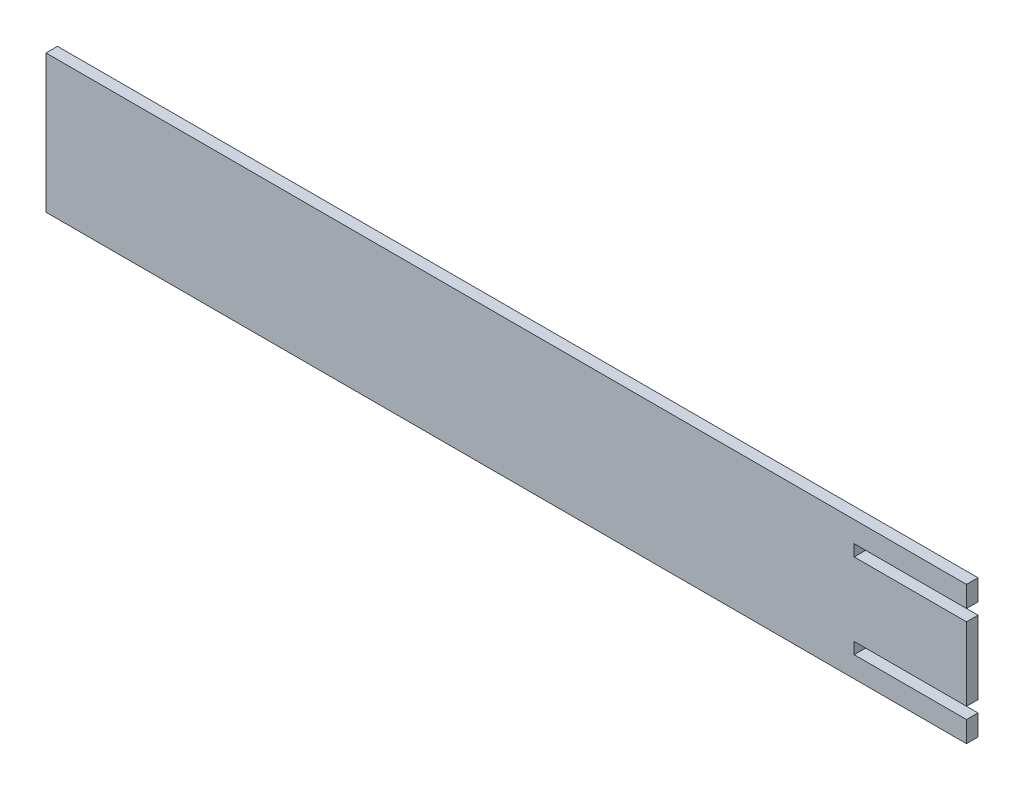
ISO-10303-21;
HEADER;
FILE_DESCRIPTION(('STEP AP214'),'2;1');
FILE_NAME('part.step','',(''),(''),'','','');
FILE_SCHEMA(('AUTOMOTIVE_DESIGN { 1 0 10303 214 1 1 1 1 }'));
ENDSEC;
DATA;
#1=APPLICATION_CONTEXT('core data for automotive mechanical design processes');
#2=APPLICATION_PROTOCOL_DEFINITION('international standard','automotive_design',2000,#1);
#3=PRODUCT_CONTEXT('',#1,'mechanical');
#4=PRODUCT('Part','Part','',(#3));
#5=PRODUCT_RELATED_PRODUCT_CATEGORY('part','',(#4));
#6=PRODUCT_DEFINITION_FORMATION('','',#4);
#7=PRODUCT_DEFINITION_CONTEXT('part definition',#1,'design');
#8=PRODUCT_DEFINITION('design','',#6,#7);
#9=PRODUCT_DEFINITION_SHAPE('','',#8);
#10=(LENGTH_UNIT() NAMED_UNIT(*) SI_UNIT(.MILLI.,.METRE.));
#11=(NAMED_UNIT(*) PLANE_ANGLE_UNIT() SI_UNIT($,.RADIAN.));
#12=(NAMED_UNIT(*) SI_UNIT($,.STERADIAN.) SOLID_ANGLE_UNIT());
#13=UNCERTAINTY_MEASURE_WITH_UNIT(LENGTH_MEASURE(1.E-05),#10,'distance_accuracy_value','');
#14=(GEOMETRIC_REPRESENTATION_CONTEXT(3) GLOBAL_UNCERTAINTY_ASSIGNED_CONTEXT((#13)) GLOBAL_UNIT_ASSIGNED_CONTEXT((#10,
#11,#12)) REPRESENTATION_CONTEXT('',''));
#15=CARTESIAN_POINT('',(0.,0.,0.));
#16=DIRECTION('',(0.,0.,1.));
#17=DIRECTION('',(1.,0.,0.));
#18=AXIS2_PLACEMENT_3D('',#15,#16,#17);
#19=CARTESIAN_POINT('',(440.34,110.08046980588,5.5));
#20=DIRECTION('',(0.,1.,0.));
#21=DIRECTION('',(0.,0.,1.));
#22=AXIS2_PLACEMENT_3D('',#19,#20,#21);
#23=PLANE('',#22);
#24=DIRECTION('',(1.,0.,0.));
#25=VECTOR('',#24,1.);
#26=CARTESIAN_POINT('',(440.34,110.08046980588,0.));
#27=LINE('',#26,#25);
#28=CARTESIAN_POINT('',(0.,110.08046980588,0.));
#29=VERTEX_POINT('',#28);
#30=CARTESIAN_POINT('',(440.34,110.08046980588,0.));
#31=VERTEX_POINT('',#30);
#32=EDGE_CURVE('E159',#29,#31,#27,.T.);
#33=ORIENTED_EDGE('',*,*,#32,.T.);
#34=DIRECTION('',(0.,0.,-1.));
#35=VECTOR('',#34,1.);
#36=CARTESIAN_POINT('',(440.34,110.08046980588,5.5));
#37=LINE('',#36,#35);
#38=CARTESIAN_POINT('',(440.34,110.08046980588,5.5));
#39=VERTEX_POINT('',#38);
#40=EDGE_CURVE('E11',#39,#31,#37,.T.);
#41=ORIENTED_EDGE('',*,*,#40,.F.);
#42=DIRECTION('',(1.,0.,0.));
#43=VECTOR('',#42,1.);
#44=CARTESIAN_POINT('',(440.34,110.08046980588,5.5));
#45=LINE('',#44,#43);
#46=CARTESIAN_POINT('',(0.,110.08046980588,5.5));
#47=VERTEX_POINT('',#46);
#48=EDGE_CURVE('E181',#47,#39,#45,.T.);
#49=ORIENTED_EDGE('',*,*,#48,.F.);
#50=DIRECTION('',(0.,0.,-1.));
#51=VECTOR('',#50,1.);
#52=CARTESIAN_POINT('',(0.,110.08046980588,5.5));
#53=LINE('',#52,#51);
#54=EDGE_CURVE('E155',#47,#29,#53,.T.);
#55=ORIENTED_EDGE('',*,*,#54,.T.);
#56=EDGE_LOOP('',(#33,#41,#49,#55));
#57=FACE_BOUND('',#56,.T.);
#58=ADVANCED_FACE('F39',(#57),#23,.F.);
#59=CARTESIAN_POINT('',(440.34,120.08046980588,5.5));
#60=DIRECTION('',(-1.,0.,0.));
#61=DIRECTION('',(0.,0.,1.));
#62=AXIS2_PLACEMENT_3D('',#59,#60,#61);
#63=PLANE('',#62);
#64=DIRECTION('',(0.,1.,0.));
#65=VECTOR('',#64,1.);
#66=CARTESIAN_POINT('',(440.34,120.08046980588,0.));
#67=LINE('',#66,#65);
#68=CARTESIAN_POINT('',(440.34,120.08046980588,0.));
#69=VERTEX_POINT('',#68);
#70=EDGE_CURVE('E162',#31,#69,#67,.T.);
#71=ORIENTED_EDGE('',*,*,#70,.T.);
#72=DIRECTION('',(0.,0.,-1.));
#73=VECTOR('',#72,1.);
#74=CARTESIAN_POINT('',(440.34,120.08046980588,5.5));
#75=LINE('',#74,#73);
#76=CARTESIAN_POINT('',(440.34,120.08046980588,5.5));
#77=VERTEX_POINT('',#76);
#78=EDGE_CURVE('E47',#77,#69,#75,.T.);
#79=ORIENTED_EDGE('',*,*,#78,.F.);
#80=DIRECTION('',(0.,1.,0.));
#81=VECTOR('',#80,1.);
#82=CARTESIAN_POINT('',(440.34,120.08046980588,5.5));
#83=LINE('',#82,#81);
#84=EDGE_CURVE('E110',#39,#77,#83,.T.);
#85=ORIENTED_EDGE('',*,*,#84,.F.);
#86=ORIENTED_EDGE('',*,*,#40,.T.);
#87=EDGE_LOOP('',(#71,#79,#85,#86));
#88=FACE_BOUND('',#87,.T.);
#89=ADVANCED_FACE('F259',(#88),#63,.F.);
#90=CARTESIAN_POINT('',(386.59,120.08046980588,5.5));
#91=DIRECTION('',(0.,-1.,0.));
#92=DIRECTION('',(0.,0.,-1.));
#93=AXIS2_PLACEMENT_3D('',#90,#91,#92);
#94=PLANE('',#93);
#95=DIRECTION('',(-1.,0.,0.));
#96=VECTOR('',#95,1.);
#97=CARTESIAN_POINT('',(386.59,120.08046980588,0.));
#98=LINE('',#97,#96);
#99=CARTESIAN_POINT('',(386.59,120.08046980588,0.));
#100=VERTEX_POINT('',#99);
#101=EDGE_CURVE('E164',#69,#100,#98,.T.);
#102=ORIENTED_EDGE('',*,*,#101,.T.);
#103=DIRECTION('',(0.,0.,-1.));
#104=VECTOR('',#103,1.);
#105=CARTESIAN_POINT('',(386.59,120.08046980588,5.5));
#106=LINE('',#105,#104);
#107=CARTESIAN_POINT('',(386.59,120.08046980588,5.5));
#108=VERTEX_POINT('',#107);
#109=EDGE_CURVE('E200',#108,#100,#106,.T.);
#110=ORIENTED_EDGE('',*,*,#109,.F.);
#111=DIRECTION('',(-1.,0.,0.));
#112=VECTOR('',#111,1.);
#113=CARTESIAN_POINT('',(386.59,120.08046980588,5.5));
#114=LINE('',#113,#112);
#115=EDGE_CURVE('E208',#77,#108,#114,.T.);
#116=ORIENTED_EDGE('',*,*,#115,.F.);
#117=ORIENTED_EDGE('',*,*,#78,.T.);
#118=EDGE_LOOP('',(#102,#110,#116,#117));
#119=FACE_BOUND('',#118,.T.);
#120=ADVANCED_FACE('F206',(#119),#94,.F.);
#121=CARTESIAN_POINT('',(386.59,125.58046980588,5.5));
#122=DIRECTION('',(-1.,0.,0.));
#123=DIRECTION('',(0.,0.,1.));
#124=AXIS2_PLACEMENT_3D('',#121,#122,#123);
#125=PLANE('',#124);
#126=DIRECTION('',(0.,1.,0.));
#127=VECTOR('',#126,1.);
#128=CARTESIAN_POINT('',(386.59,125.58046980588,0.));
#129=LINE('',#128,#127);
#130=CARTESIAN_POINT('',(386.59,125.58046980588,0.));
#131=VERTEX_POINT('',#130);
#132=EDGE_CURVE('E166',#100,#131,#129,.T.);
#133=ORIENTED_EDGE('',*,*,#132,.T.);
#134=DIRECTION('',(0.,0.,-1.));
#135=VECTOR('',#134,1.);
#136=CARTESIAN_POINT('',(386.59,125.58046980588,5.5));
#137=LINE('',#136,#135);
#138=CARTESIAN_POINT('',(386.59,125.58046980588,5.5));
#139=VERTEX_POINT('',#138);
#140=EDGE_CURVE('E197',#139,#131,#137,.T.);
#141=ORIENTED_EDGE('',*,*,#140,.F.);
#142=DIRECTION('',(0.,1.,0.));
#143=VECTOR('',#142,1.);
#144=CARTESIAN_POINT('',(386.59,125.58046980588,5.5));
#145=LINE('',#144,#143);
#146=EDGE_CURVE('E226',#108,#139,#145,.T.);
#147=ORIENTED_EDGE('',*,*,#146,.F.);
#148=ORIENTED_EDGE('',*,*,#109,.T.);
#149=EDGE_LOOP('',(#133,#141,#147,#148));
#150=FACE_BOUND('',#149,.T.);
#151=ADVANCED_FACE('F217',(#150),#125,.F.);
#152=CARTESIAN_POINT('',(440.34,125.58046980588,5.5));
#153=DIRECTION('',(0.,1.,0.));
#154=DIRECTION('',(0.,0.,1.));
#155=AXIS2_PLACEMENT_3D('',#152,#153,#154);
#156=PLANE('',#155);
#157=DIRECTION('',(1.,0.,0.));
#158=VECTOR('',#157,1.);
#159=CARTESIAN_POINT('',(440.34,125.58046980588,0.));
#160=LINE('',#159,#158);
#161=CARTESIAN_POINT('',(440.34,125.58046980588,0.));
#162=VERTEX_POINT('',#161);
#163=EDGE_CURVE('E168',#131,#162,#160,.T.);
#164=ORIENTED_EDGE('',*,*,#163,.T.);
#165=DIRECTION('',(0.,0.,-1.));
#166=VECTOR('',#165,1.);
#167=CARTESIAN_POINT('',(440.34,125.58046980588,5.5));
#168=LINE('',#167,#166);
#169=CARTESIAN_POINT('',(440.34,125.58046980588,5.5));
#170=VERTEX_POINT('',#169);
#171=EDGE_CURVE('E194',#170,#162,#168,.T.);
#172=ORIENTED_EDGE('',*,*,#171,.F.);
#173=DIRECTION('',(1.,0.,0.));
#174=VECTOR('',#173,1.);
#175=CARTESIAN_POINT('',(440.34,125.58046980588,5.5));
#176=LINE('',#175,#174);
#177=EDGE_CURVE('E223',#139,#170,#176,.T.);
#178=ORIENTED_EDGE('',*,*,#177,.F.);
#179=ORIENTED_EDGE('',*,*,#140,.T.);
#180=EDGE_LOOP('',(#164,#172,#178,#179));
#181=FACE_BOUND('',#180,.T.);
#182=ADVANCED_FACE('F221',(#181),#156,.F.);
#183=CARTESIAN_POINT('',(440.34,160.58046980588,5.5));
#184=DIRECTION('',(-1.,0.,0.));
#185=DIRECTION('',(0.,0.,1.));
#186=AXIS2_PLACEMENT_3D('',#183,#184,#185);
#187=PLANE('',#186);
#188=DIRECTION('',(0.,1.,0.));
#189=VECTOR('',#188,1.);
#190=CARTESIAN_POINT('',(440.34,160.58046980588,0.));
#191=LINE('',#190,#189);
#192=CARTESIAN_POINT('',(440.34,160.58046980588,0.));
#193=VERTEX_POINT('',#192);
#194=EDGE_CURVE('E170',#162,#193,#191,.T.);
#195=ORIENTED_EDGE('',*,*,#194,.T.);
#196=DIRECTION('',(0.,0.,-1.));
#197=VECTOR('',#196,1.);
#198=CARTESIAN_POINT('',(440.34,160.58046980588,5.5));
#199=LINE('',#198,#197);
#200=CARTESIAN_POINT('',(440.34,160.58046980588,5.5));
#201=VERTEX_POINT('',#200);
#202=EDGE_CURVE('E191',#201,#193,#199,.T.);
#203=ORIENTED_EDGE('',*,*,#202,.F.);
#204=DIRECTION('',(0.,1.,0.));
#205=VECTOR('',#204,1.);
#206=CARTESIAN_POINT('',(440.34,160.58046980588,5.5));
#207=LINE('',#206,#205);
#208=EDGE_CURVE('E225',#170,#201,#207,.T.);
#209=ORIENTED_EDGE('',*,*,#208,.F.);
#210=ORIENTED_EDGE('',*,*,#171,.T.);
#211=EDGE_LOOP('',(#195,#203,#209,#210));
#212=FACE_BOUND('',#211,.T.);
#213=ADVANCED_FACE('F272',(#212),#187,.F.);
#214=CARTESIAN_POINT('',(386.59,160.58046980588,5.5));
#215=DIRECTION('',(0.,-1.,0.));
#216=DIRECTION('',(0.,0.,-1.));
#217=AXIS2_PLACEMENT_3D('',#214,#215,#216);
#218=PLANE('',#217);
#219=DIRECTION('',(-1.,0.,0.));
#220=VECTOR('',#219,1.);
#221=CARTESIAN_POINT('',(386.59,160.58046980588,0.));
#222=LINE('',#221,#220);
#223=CARTESIAN_POINT('',(386.59,160.58046980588,0.));
#224=VERTEX_POINT('',#223);
#225=EDGE_CURVE('E172',#193,#224,#222,.T.);
#226=ORIENTED_EDGE('',*,*,#225,.T.);
#227=DIRECTION('',(0.,0.,-1.));
#228=VECTOR('',#227,1.);
#229=CARTESIAN_POINT('',(386.59,160.58046980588,5.5));
#230=LINE('',#229,#228);
#231=CARTESIAN_POINT('',(386.59,160.58046980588,5.5));
#232=VERTEX_POINT('',#231);
#233=EDGE_CURVE('E188',#232,#224,#230,.T.);
#234=ORIENTED_EDGE('',*,*,#233,.F.);
#235=DIRECTION('',(-1.,0.,0.));
#236=VECTOR('',#235,1.);
#237=CARTESIAN_POINT('',(386.59,160.58046980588,5.5));
#238=LINE('',#237,#236);
#239=EDGE_CURVE('E228',#201,#232,#238,.T.);
#240=ORIENTED_EDGE('',*,*,#239,.F.);
#241=ORIENTED_EDGE('',*,*,#202,.T.);
#242=EDGE_LOOP('',(#226,#234,#240,#241));
#243=FACE_BOUND('',#242,.T.);
#244=ADVANCED_FACE('F275',(#243),#218,.F.);
#245=CARTESIAN_POINT('',(386.59,166.08046980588,5.5));
#246=DIRECTION('',(-1.,0.,0.));
#247=DIRECTION('',(0.,0.,1.));
#248=AXIS2_PLACEMENT_3D('',#245,#246,#247);
#249=PLANE('',#248);
#250=DIRECTION('',(0.,1.,0.));
#251=VECTOR('',#250,1.);
#252=CARTESIAN_POINT('',(386.59,166.08046980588,0.));
#253=LINE('',#252,#251);
#254=CARTESIAN_POINT('',(386.59,166.08046980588,0.));
#255=VERTEX_POINT('',#254);
#256=EDGE_CURVE('E174',#224,#255,#253,.T.);
#257=ORIENTED_EDGE('',*,*,#256,.T.);
#258=DIRECTION('',(0.,0.,-1.));
#259=VECTOR('',#258,1.);
#260=CARTESIAN_POINT('',(386.59,166.08046980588,5.5));
#261=LINE('',#260,#259);
#262=CARTESIAN_POINT('',(386.59,166.08046980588,5.5));
#263=VERTEX_POINT('',#262);
#264=EDGE_CURVE('E185',#263,#255,#261,.T.);
#265=ORIENTED_EDGE('',*,*,#264,.F.);
#266=DIRECTION('',(0.,1.,0.));
#267=VECTOR('',#266,1.);
#268=CARTESIAN_POINT('',(386.59,166.08046980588,5.5));
#269=LINE('',#268,#267);
#270=EDGE_CURVE('E234',#232,#263,#269,.T.);
#271=ORIENTED_EDGE('',*,*,#270,.F.);
#272=ORIENTED_EDGE('',*,*,#233,.T.);
#273=EDGE_LOOP('',(#257,#265,#271,#272));
#274=FACE_BOUND('',#273,.T.);
#275=ADVANCED_FACE('F240',(#274),#249,.F.);
#276=CARTESIAN_POINT('',(440.34,166.08046980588,5.5));
#277=DIRECTION('',(0.,1.,0.));
#278=DIRECTION('',(0.,0.,1.));
#279=AXIS2_PLACEMENT_3D('',#276,#277,#278);
#280=PLANE('',#279);
#281=DIRECTION('',(1.,0.,0.));
#282=VECTOR('',#281,1.);
#283=CARTESIAN_POINT('',(440.34,166.08046980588,0.));
#284=LINE('',#283,#282);
#285=CARTESIAN_POINT('',(440.34,166.08046980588,0.));
#286=VERTEX_POINT('',#285);
#287=EDGE_CURVE('E176',#255,#286,#284,.T.);
#288=ORIENTED_EDGE('',*,*,#287,.T.);
#289=DIRECTION('',(0.,0.,-1.));
#290=VECTOR('',#289,1.);
#291=CARTESIAN_POINT('',(440.34,166.08046980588,5.5));
#292=LINE('',#291,#290);
#293=CARTESIAN_POINT('',(440.34,166.08046980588,5.5));
#294=VERTEX_POINT('',#293);
#295=EDGE_CURVE('E150',#294,#286,#292,.T.);
#296=ORIENTED_EDGE('',*,*,#295,.F.);
#297=DIRECTION('',(1.,0.,0.));
#298=VECTOR('',#297,1.);
#299=CARTESIAN_POINT('',(440.34,166.08046980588,5.5));
#300=LINE('',#299,#298);
#301=EDGE_CURVE('E141',#263,#294,#300,.T.);
#302=ORIENTED_EDGE('',*,*,#301,.F.);
#303=ORIENTED_EDGE('',*,*,#264,.T.);
#304=EDGE_LOOP('',(#288,#296,#302,#303));
#305=FACE_BOUND('',#304,.T.);
#306=ADVANCED_FACE('F244',(#305),#280,.F.);
#307=CARTESIAN_POINT('',(440.34,176.08046980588,5.5));
#308=DIRECTION('',(-1.,0.,0.));
#309=DIRECTION('',(0.,0.,1.));
#310=AXIS2_PLACEMENT_3D('',#307,#308,#309);
#311=PLANE('',#310);
#312=DIRECTION('',(0.,1.,0.));
#313=VECTOR('',#312,1.);
#314=CARTESIAN_POINT('',(440.34,176.08046980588,0.));
#315=LINE('',#314,#313);
#316=CARTESIAN_POINT('',(440.34,176.08046980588,0.));
#317=VERTEX_POINT('',#316);
#318=EDGE_CURVE('E149',#286,#317,#315,.T.);
#319=ORIENTED_EDGE('',*,*,#318,.T.);
#320=DIRECTION('',(0.,0.,-1.));
#321=VECTOR('',#320,1.);
#322=CARTESIAN_POINT('',(440.34,176.08046980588,5.5));
#323=LINE('',#322,#321);
#324=CARTESIAN_POINT('',(440.34,176.08046980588,5.5));
#325=VERTEX_POINT('',#324);
#326=EDGE_CURVE('E146',#325,#317,#323,.T.);
#327=ORIENTED_EDGE('',*,*,#326,.F.);
#328=DIRECTION('',(0.,1.,0.));
#329=VECTOR('',#328,1.);
#330=CARTESIAN_POINT('',(440.34,176.08046980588,5.5));
#331=LINE('',#330,#329);
#332=EDGE_CURVE('E135',#294,#325,#331,.T.);
#333=ORIENTED_EDGE('',*,*,#332,.F.);
#334=ORIENTED_EDGE('',*,*,#295,.T.);
#335=EDGE_LOOP('',(#319,#327,#333,#334));
#336=FACE_BOUND('',#335,.T.);
#337=ADVANCED_FACE('F147',(#336),#311,.F.);
#338=CARTESIAN_POINT('',(0.,176.08046980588,5.5));
#339=DIRECTION('',(0.,-1.,0.));
#340=DIRECTION('',(0.,0.,-1.));
#341=AXIS2_PLACEMENT_3D('',#338,#339,#340);
#342=PLANE('',#341);
#343=DIRECTION('',(-1.,0.,0.));
#344=VECTOR('',#343,1.);
#345=CARTESIAN_POINT('',(0.,176.08046980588,0.));
#346=LINE('',#345,#344);
#347=CARTESIAN_POINT('',(0.,176.08046980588,0.));
#348=VERTEX_POINT('',#347);
#349=EDGE_CURVE('E96',#317,#348,#346,.T.);
#350=ORIENTED_EDGE('',*,*,#349,.T.);
#351=DIRECTION('',(0.,0.,-1.));
#352=VECTOR('',#351,1.);
#353=CARTESIAN_POINT('',(0.,176.08046980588,5.5));
#354=LINE('',#353,#352);
#355=CARTESIAN_POINT('',(0.,176.08046980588,5.5));
#356=VERTEX_POINT('',#355);
#357=EDGE_CURVE('E151',#356,#348,#354,.T.);
#358=ORIENTED_EDGE('',*,*,#357,.F.);
#359=DIRECTION('',(-1.,0.,0.));
#360=VECTOR('',#359,1.);
#361=CARTESIAN_POINT('',(0.,176.08046980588,5.5));
#362=LINE('',#361,#360);
#363=EDGE_CURVE('E139',#325,#356,#362,.T.);
#364=ORIENTED_EDGE('',*,*,#363,.F.);
#365=ORIENTED_EDGE('',*,*,#326,.T.);
#366=EDGE_LOOP('',(#350,#358,#364,#365));
#367=FACE_BOUND('',#366,.T.);
#368=ADVANCED_FACE('F153',(#367),#342,.F.);
#369=CARTESIAN_POINT('',(0.,110.08046980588,5.5));
#370=DIRECTION('',(1.,0.,0.));
#371=DIRECTION('',(0.,0.,-1.));
#372=AXIS2_PLACEMENT_3D('',#369,#370,#371);
#373=PLANE('',#372);
#374=DIRECTION('',(0.,-1.,0.));
#375=VECTOR('',#374,1.);
#376=CARTESIAN_POINT('',(0.,110.08046980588,0.));
#377=LINE('',#376,#375);
#378=EDGE_CURVE('E102',#348,#29,#377,.T.);
#379=ORIENTED_EDGE('',*,*,#378,.T.);
#380=ORIENTED_EDGE('',*,*,#54,.F.);
#381=DIRECTION('',(0.,-1.,0.));
#382=VECTOR('',#381,1.);
#383=CARTESIAN_POINT('',(0.,110.08046980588,5.5));
#384=LINE('',#383,#382);
#385=EDGE_CURVE('E55',#356,#47,#384,.T.);
#386=ORIENTED_EDGE('',*,*,#385,.F.);
#387=ORIENTED_EDGE('',*,*,#357,.T.);
#388=EDGE_LOOP('',(#379,#380,#386,#387));
#389=FACE_BOUND('',#388,.T.);
#390=ADVANCED_FACE('F248',(#389),#373,.F.);
#391=CARTESIAN_POINT('',(0.,0.,5.5));
#392=DIRECTION('',(0.,0.,-1.));
#393=DIRECTION('',(-1.,0.,0.));
#394=AXIS2_PLACEMENT_3D('',#391,#392,#393);
#395=PLANE('',#394);
#396=ORIENTED_EDGE('',*,*,#48,.T.);
#397=ORIENTED_EDGE('',*,*,#84,.T.);
#398=ORIENTED_EDGE('',*,*,#115,.T.);
#399=ORIENTED_EDGE('',*,*,#146,.T.);
#400=ORIENTED_EDGE('',*,*,#177,.T.);
#401=ORIENTED_EDGE('',*,*,#208,.T.);
#402=ORIENTED_EDGE('',*,*,#239,.T.);
#403=ORIENTED_EDGE('',*,*,#270,.T.);
#404=ORIENTED_EDGE('',*,*,#301,.T.);
#405=ORIENTED_EDGE('',*,*,#332,.T.);
#406=ORIENTED_EDGE('',*,*,#363,.T.);
#407=ORIENTED_EDGE('',*,*,#385,.T.);
#408=EDGE_LOOP('',(#396,#397,#398,#399,#400,#401,#402,#403,#404,#405,#406,#407));
#409=FACE_BOUND('',#408,.T.);
#410=ADVANCED_FACE('F137',(#409),#395,.F.);
#411=CARTESIAN_POINT('',(0.,0.,0.));
#412=DIRECTION('',(0.,0.,-1.));
#413=DIRECTION('',(-1.,0.,0.));
#414=AXIS2_PLACEMENT_3D('',#411,#412,#413);
#415=PLANE('',#414);
#416=ORIENTED_EDGE('',*,*,#32,.F.);
#417=ORIENTED_EDGE('',*,*,#378,.F.);
#418=ORIENTED_EDGE('',*,*,#349,.F.);
#419=ORIENTED_EDGE('',*,*,#318,.F.);
#420=ORIENTED_EDGE('',*,*,#287,.F.);
#421=ORIENTED_EDGE('',*,*,#256,.F.);
#422=ORIENTED_EDGE('',*,*,#225,.F.);
#423=ORIENTED_EDGE('',*,*,#194,.F.);
#424=ORIENTED_EDGE('',*,*,#163,.F.);
#425=ORIENTED_EDGE('',*,*,#132,.F.);
#426=ORIENTED_EDGE('',*,*,#101,.F.);
#427=ORIENTED_EDGE('',*,*,#70,.F.);
#428=EDGE_LOOP('',(#416,#417,#418,#419,#420,#421,#422,#423,#424,#425,#426,#427));
#429=FACE_BOUND('',#428,.T.);
#430=ADVANCED_FACE('F212',(#429),#415,.T.);
#431=CLOSED_SHELL('',(#58,#89,#120,#151,#182,#213,#244,#275,#306,#337,#368,#390,#410,#430));
#432=MANIFOLD_SOLID_BREP('B2',#431);
#433=ADVANCED_BREP_SHAPE_REPRESENTATION('',(#18,#432),#14);
#434=SHAPE_DEFINITION_REPRESENTATION(#9,#433);
ENDSEC;
END-ISO-10303-21;
